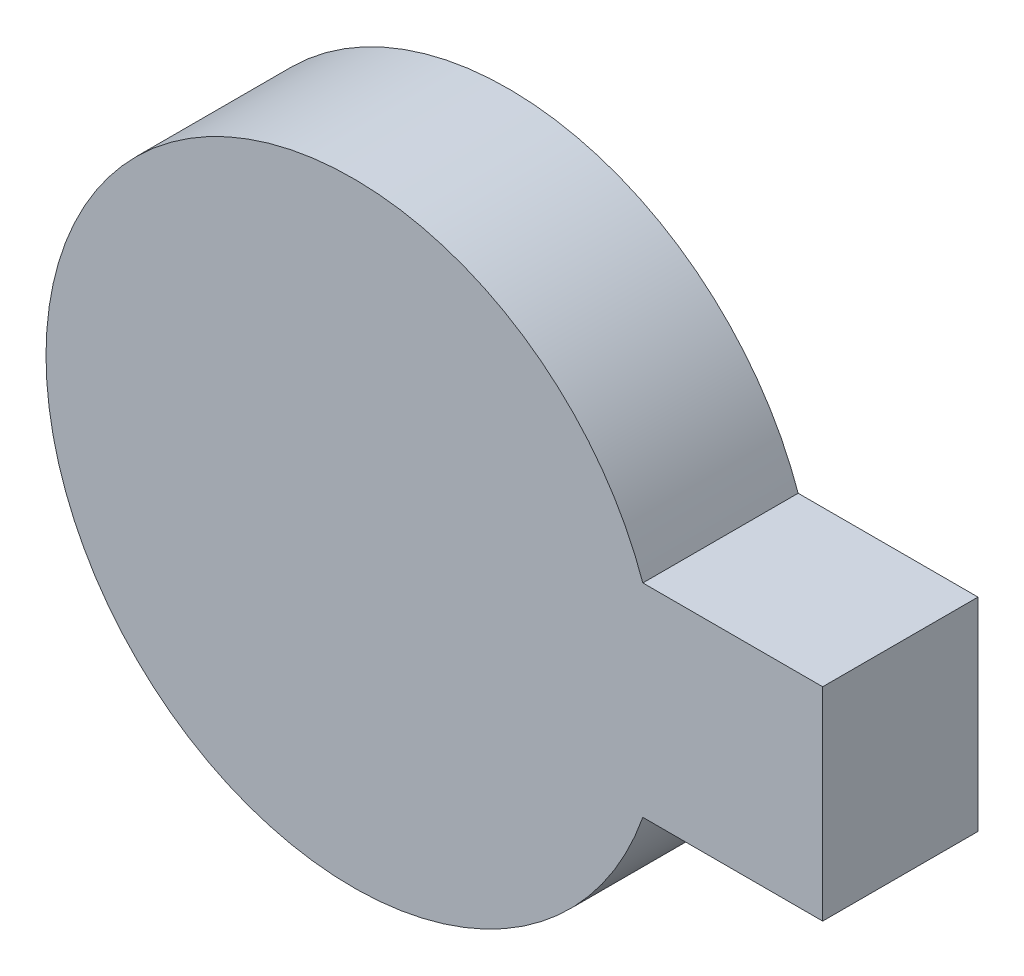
ISO-10303-21;
HEADER;
FILE_DESCRIPTION(('STEP AP214'),'2;1');
FILE_NAME('part.step','',(''),(''),'','','');
FILE_SCHEMA(('AUTOMOTIVE_DESIGN { 1 0 10303 214 1 1 1 1 }'));
ENDSEC;
DATA;
#1=APPLICATION_CONTEXT('core data for automotive mechanical design processes');
#2=APPLICATION_PROTOCOL_DEFINITION('international standard','automotive_design',2000,#1);
#3=PRODUCT_CONTEXT('',#1,'mechanical');
#4=PRODUCT('Part','Part','',(#3));
#5=PRODUCT_RELATED_PRODUCT_CATEGORY('part','',(#4));
#6=PRODUCT_DEFINITION_FORMATION('','',#4);
#7=PRODUCT_DEFINITION_CONTEXT('part definition',#1,'design');
#8=PRODUCT_DEFINITION('design','',#6,#7);
#9=PRODUCT_DEFINITION_SHAPE('','',#8);
#10=(LENGTH_UNIT() NAMED_UNIT(*) SI_UNIT(.MILLI.,.METRE.));
#11=(NAMED_UNIT(*) PLANE_ANGLE_UNIT() SI_UNIT($,.RADIAN.));
#12=(NAMED_UNIT(*) SI_UNIT($,.STERADIAN.) SOLID_ANGLE_UNIT());
#13=UNCERTAINTY_MEASURE_WITH_UNIT(LENGTH_MEASURE(1.E-05),#10,'distance_accuracy_value','');
#14=(GEOMETRIC_REPRESENTATION_CONTEXT(3) GLOBAL_UNCERTAINTY_ASSIGNED_CONTEXT((#13)) GLOBAL_UNIT_ASSIGNED_CONTEXT((#10,
#11,#12)) REPRESENTATION_CONTEXT('',''));
#15=CARTESIAN_POINT('',(0.,0.,0.));
#16=DIRECTION('',(0.,0.,1.));
#17=DIRECTION('',(1.,0.,0.));
#18=AXIS2_PLACEMENT_3D('',#15,#16,#17);
#19=CARTESIAN_POINT('',(0.,2.4892,3.81));
#20=DIRECTION('',(0.,1.,0.));
#21=DIRECTION('',(0.,0.,1.));
#22=AXIS2_PLACEMENT_3D('',#19,#20,#21);
#23=PLANE('',#22);
#24=DIRECTION('',(1.,0.,0.));
#25=VECTOR('',#24,1.);
#26=CARTESIAN_POINT('',(0.,2.4892,0.));
#27=LINE('',#26,#25);
#28=CARTESIAN_POINT('',(7.10783726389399,2.4892,0.));
#29=VERTEX_POINT('',#28);
#30=CARTESIAN_POINT('',(11.5189,2.4892,0.));
#31=VERTEX_POINT('',#30);
#32=EDGE_CURVE('E96',#29,#31,#27,.T.);
#33=ORIENTED_EDGE('',*,*,#32,.F.);
#34=DIRECTION('',(0.,0.,-1.));
#35=VECTOR('',#34,1.);
#36=CARTESIAN_POINT('',(7.10783726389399,2.4892,3.81));
#37=LINE('',#36,#35);
#38=CARTESIAN_POINT('',(7.10783726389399,2.4892,3.81));
#39=VERTEX_POINT('',#38);
#40=EDGE_CURVE('E11',#39,#29,#37,.T.);
#41=ORIENTED_EDGE('',*,*,#40,.F.);
#42=DIRECTION('',(1.,0.,0.));
#43=VECTOR('',#42,1.);
#44=CARTESIAN_POINT('',(0.,2.4892,3.81));
#45=LINE('',#44,#43);
#46=CARTESIAN_POINT('',(11.5189,2.4892,3.81));
#47=VERTEX_POINT('',#46);
#48=EDGE_CURVE('E81',#39,#47,#45,.T.);
#49=ORIENTED_EDGE('',*,*,#48,.T.);
#50=DIRECTION('',(0.,0.,-1.));
#51=VECTOR('',#50,1.);
#52=CARTESIAN_POINT('',(11.5189,2.4892,3.81));
#53=LINE('',#52,#51);
#54=EDGE_CURVE('E49',#47,#31,#53,.T.);
#55=ORIENTED_EDGE('',*,*,#54,.T.);
#56=EDGE_LOOP('',(#33,#41,#49,#55));
#57=FACE_BOUND('',#56,.T.);
#58=ADVANCED_FACE('F33',(#57),#23,.T.);
#59=CARTESIAN_POINT('',(0.,0.,3.81));
#60=DIRECTION('',(0.,0.,-1.));
#61=DIRECTION('',(-1.,0.,0.));
#62=AXIS2_PLACEMENT_3D('',#59,#60,#61);
#63=CYLINDRICAL_SURFACE('',#62,7.5311);
#64=CARTESIAN_POINT('',(0.,0.,0.));
#65=DIRECTION('',(0.,0.,1.));
#66=DIRECTION('',(1.,0.,0.));
#67=AXIS2_PLACEMENT_3D('',#64,#65,#66);
#68=CIRCLE('',#67,7.5311);
#69=CARTESIAN_POINT('',(7.10783726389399,-2.4892,0.));
#70=VERTEX_POINT('',#69);
#71=EDGE_CURVE('E87',#29,#70,#68,.T.);
#72=ORIENTED_EDGE('',*,*,#71,.T.);
#73=DIRECTION('',(0.,0.,-1.));
#74=VECTOR('',#73,1.);
#75=CARTESIAN_POINT('',(7.10783726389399,-2.4892,3.81));
#76=LINE('',#75,#74);
#77=CARTESIAN_POINT('',(7.10783726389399,-2.4892,3.81));
#78=VERTEX_POINT('',#77);
#79=EDGE_CURVE('E41',#78,#70,#76,.T.);
#80=ORIENTED_EDGE('',*,*,#79,.F.);
#81=CARTESIAN_POINT('',(0.,0.,3.81));
#82=DIRECTION('',(0.,0.,1.));
#83=DIRECTION('',(1.,0.,0.));
#84=AXIS2_PLACEMENT_3D('',#81,#82,#83);
#85=CIRCLE('',#84,7.5311);
#86=EDGE_CURVE('E75',#39,#78,#85,.T.);
#87=ORIENTED_EDGE('',*,*,#86,.F.);
#88=ORIENTED_EDGE('',*,*,#40,.T.);
#89=EDGE_LOOP('',(#72,#80,#87,#88));
#90=FACE_BOUND('',#89,.T.);
#91=ADVANCED_FACE('F85',(#90),#63,.T.);
#92=CARTESIAN_POINT('',(0.,-2.4892,3.81));
#93=DIRECTION('',(0.,1.,0.));
#94=DIRECTION('',(0.,0.,1.));
#95=AXIS2_PLACEMENT_3D('',#92,#93,#94);
#96=PLANE('',#95);
#97=DIRECTION('',(1.,0.,0.));
#98=VECTOR('',#97,1.);
#99=CARTESIAN_POINT('',(0.,-2.4892,0.));
#100=LINE('',#99,#98);
#101=CARTESIAN_POINT('',(11.5189,-2.4892,0.));
#102=VERTEX_POINT('',#101);
#103=EDGE_CURVE('E99',#70,#102,#100,.T.);
#104=ORIENTED_EDGE('',*,*,#103,.T.);
#105=DIRECTION('',(0.,0.,-1.));
#106=VECTOR('',#105,1.);
#107=CARTESIAN_POINT('',(11.5189,-2.4892,3.81));
#108=LINE('',#107,#106);
#109=CARTESIAN_POINT('',(11.5189,-2.4892,3.81));
#110=VERTEX_POINT('',#109);
#111=EDGE_CURVE('E63',#110,#102,#108,.T.);
#112=ORIENTED_EDGE('',*,*,#111,.F.);
#113=DIRECTION('',(1.,0.,0.));
#114=VECTOR('',#113,1.);
#115=CARTESIAN_POINT('',(0.,-2.4892,3.81));
#116=LINE('',#115,#114);
#117=EDGE_CURVE('E80',#78,#110,#116,.T.);
#118=ORIENTED_EDGE('',*,*,#117,.F.);
#119=ORIENTED_EDGE('',*,*,#79,.T.);
#120=EDGE_LOOP('',(#104,#112,#118,#119));
#121=FACE_BOUND('',#120,.T.);
#122=ADVANCED_FACE('F90',(#121),#96,.F.);
#123=CARTESIAN_POINT('',(11.5189,0.,3.81));
#124=DIRECTION('',(1.,0.,0.));
#125=DIRECTION('',(0.,0.,-1.));
#126=AXIS2_PLACEMENT_3D('',#123,#124,#125);
#127=PLANE('',#126);
#128=DIRECTION('',(0.,-1.,0.));
#129=VECTOR('',#128,1.);
#130=CARTESIAN_POINT('',(11.5189,0.,0.));
#131=LINE('',#130,#129);
#132=EDGE_CURVE('E101',#31,#102,#131,.T.);
#133=ORIENTED_EDGE('',*,*,#132,.F.);
#134=ORIENTED_EDGE('',*,*,#54,.F.);
#135=DIRECTION('',(0.,-1.,0.));
#136=VECTOR('',#135,1.);
#137=CARTESIAN_POINT('',(11.5189,0.,3.81));
#138=LINE('',#137,#136);
#139=EDGE_CURVE('E91',#47,#110,#138,.T.);
#140=ORIENTED_EDGE('',*,*,#139,.T.);
#141=ORIENTED_EDGE('',*,*,#111,.T.);
#142=EDGE_LOOP('',(#133,#134,#140,#141));
#143=FACE_BOUND('',#142,.T.);
#144=ADVANCED_FACE('F106',(#143),#127,.T.);
#145=CARTESIAN_POINT('',(0.,0.,3.81));
#146=DIRECTION('',(0.,0.,1.));
#147=DIRECTION('',(1.,0.,0.));
#148=AXIS2_PLACEMENT_3D('',#145,#146,#147);
#149=PLANE('',#148);
#150=ORIENTED_EDGE('',*,*,#48,.F.);
#151=ORIENTED_EDGE('',*,*,#86,.T.);
#152=ORIENTED_EDGE('',*,*,#117,.T.);
#153=ORIENTED_EDGE('',*,*,#139,.F.);
#154=EDGE_LOOP('',(#150,#151,#152,#153));
#155=FACE_BOUND('',#154,.T.);
#156=ADVANCED_FACE('F77',(#155),#149,.T.);
#157=CARTESIAN_POINT('',(0.,0.,0.));
#158=DIRECTION('',(0.,0.,1.));
#159=DIRECTION('',(1.,0.,0.));
#160=AXIS2_PLACEMENT_3D('',#157,#158,#159);
#161=PLANE('',#160);
#162=ORIENTED_EDGE('',*,*,#32,.T.);
#163=ORIENTED_EDGE('',*,*,#132,.T.);
#164=ORIENTED_EDGE('',*,*,#103,.F.);
#165=ORIENTED_EDGE('',*,*,#71,.F.);
#166=EDGE_LOOP('',(#162,#163,#164,#165));
#167=FACE_BOUND('',#166,.T.);
#168=ADVANCED_FACE('F113',(#167),#161,.F.);
#169=CLOSED_SHELL('',(#58,#91,#122,#144,#156,#168));
#170=MANIFOLD_SOLID_BREP('B2',#169);
#171=ADVANCED_BREP_SHAPE_REPRESENTATION('',(#18,#170),#14);
#172=SHAPE_DEFINITION_REPRESENTATION(#9,#171);
ENDSEC;
END-ISO-10303-21;
